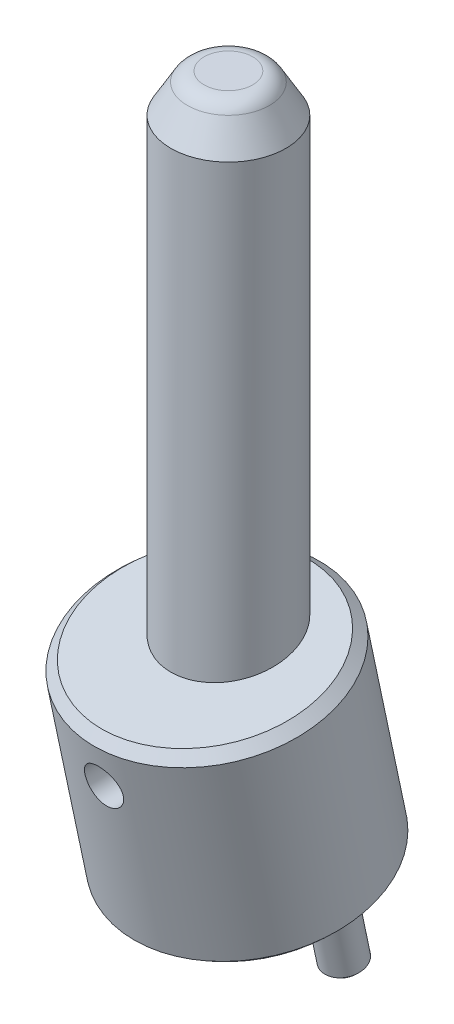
ISO-10303-21;
HEADER;
FILE_DESCRIPTION(('STEP AP214'),'2;1');
FILE_NAME('part.step','',(''),(''),'','','');
FILE_SCHEMA(('AUTOMOTIVE_DESIGN { 1 0 10303 214 1 1 1 1 }'));
ENDSEC;
DATA;
#1=APPLICATION_CONTEXT('core data for automotive mechanical design processes');
#2=APPLICATION_PROTOCOL_DEFINITION('international standard','automotive_design',2000,#1);
#3=PRODUCT_CONTEXT('',#1,'mechanical');
#4=PRODUCT('Part','Part','',(#3));
#5=PRODUCT_RELATED_PRODUCT_CATEGORY('part','',(#4));
#6=PRODUCT_DEFINITION_FORMATION('','',#4);
#7=PRODUCT_DEFINITION_CONTEXT('part definition',#1,'design');
#8=PRODUCT_DEFINITION('design','',#6,#7);
#9=PRODUCT_DEFINITION_SHAPE('','',#8);
#10=(LENGTH_UNIT() NAMED_UNIT(*) SI_UNIT(.MILLI.,.METRE.));
#11=(NAMED_UNIT(*) PLANE_ANGLE_UNIT() SI_UNIT($,.RADIAN.));
#12=(NAMED_UNIT(*) SI_UNIT($,.STERADIAN.) SOLID_ANGLE_UNIT());
#13=UNCERTAINTY_MEASURE_WITH_UNIT(LENGTH_MEASURE(1.E-05),#10,'distance_accuracy_value','');
#14=(GEOMETRIC_REPRESENTATION_CONTEXT(3) GLOBAL_UNCERTAINTY_ASSIGNED_CONTEXT((#13)) GLOBAL_UNIT_ASSIGNED_CONTEXT((#10,
#11,#12)) REPRESENTATION_CONTEXT('',''));
#15=CARTESIAN_POINT('',(0.,0.,0.));
#16=DIRECTION('',(0.,0.,1.));
#17=DIRECTION('',(1.,0.,0.));
#18=AXIS2_PLACEMENT_3D('',#15,#16,#17);
#19=CARTESIAN_POINT('',(0.,68.,0.));
#20=DIRECTION('',(0.,1.,0.));
#21=DIRECTION('',(-1.,0.,0.));
#22=AXIS2_PLACEMENT_3D('',#19,#20,#21);
#23=PLANE('',#22);
#24=CARTESIAN_POINT('',(0.,68.,-2.535898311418));
#25=CARTESIAN_POINT('',(0.036883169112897,68.,-2.53589886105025));
#26=CARTESIAN_POINT('',(0.073766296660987,68.,-2.53509366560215));
#27=CARTESIAN_POINT('',(0.147462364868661,68.,-2.53187573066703));
#28=CARTESIAN_POINT('',(0.184275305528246,68.,-2.52946299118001));
#29=CARTESIAN_POINT('',(0.257760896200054,68.,-2.52303391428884));
#30=CARTESIAN_POINT('',(0.294433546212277,68.,-2.51901757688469));
#31=CARTESIAN_POINT('',(0.367568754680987,68.,-2.50938912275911));
#32=CARTESIAN_POINT('',(0.404031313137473,68.,-2.50377700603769));
#33=CARTESIAN_POINT('',(0.476676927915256,68.,-2.49096762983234));
#34=CARTESIAN_POINT('',(0.512859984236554,68.,-2.48377037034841));
#35=CARTESIAN_POINT('',(0.584877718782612,68.,-2.46780442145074));
#36=CARTESIAN_POINT('',(0.620712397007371,68.,-2.459035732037));
#37=CARTESIAN_POINT('',(0.6919651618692,68.,-2.43994361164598));
#38=CARTESIAN_POINT('',(0.72738324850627,68.,-2.42962018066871));
#39=CARTESIAN_POINT('',(0.79773540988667,68.,-2.4074382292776));
#40=CARTESIAN_POINT('',(0.83266948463,68.,-2.39557970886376));
#41=CARTESIAN_POINT('',(0.901987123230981,68.,-2.37035015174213));
#42=CARTESIAN_POINT('',(0.936370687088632,68.,-2.35697911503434));
#43=CARTESIAN_POINT('',(1.00452185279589,68.,-2.32874997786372));
#44=CARTESIAN_POINT('',(1.0382894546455,68.,-2.31389187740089));
#45=CARTESIAN_POINT('',(1.10514441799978,68.,-2.28271689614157));
#46=CARTESIAN_POINT('',(1.13823177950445,68.,-2.26640001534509));
#47=CARTESIAN_POINT('',(1.20366327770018,68.,-2.23233853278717));
#48=CARTESIAN_POINT('',(1.23600741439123,68.,-2.21459393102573));
#49=CARTESIAN_POINT('',(1.29989089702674,68.,-2.17771078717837));
#50=CARTESIAN_POINT('',(1.3314302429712,68.,-2.15857224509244));
#51=CARTESIAN_POINT('',(1.3936440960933,68.,-2.11893764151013));
#52=CARTESIAN_POINT('',(1.42431860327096,67.9999999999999,-2.09844158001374));
#53=CARTESIAN_POINT('',(1.48474442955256,68.0000000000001,-2.05613099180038));
#54=CARTESIAN_POINT('',(1.51449574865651,68.0000000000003,-2.03431646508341));
#55=CARTESIAN_POINT('',(1.57301841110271,67.9999999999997,-1.98941032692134));
#56=CARTESIAN_POINT('',(1.60178975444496,67.9999999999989,-1.96631871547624));
#57=CARTESIAN_POINT('',(1.65829827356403,68.0000000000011,-1.91890290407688));
#58=CARTESIAN_POINT('',(1.68603544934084,68.0000000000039,-1.89457870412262));
#59=CARTESIAN_POINT('',(1.74042068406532,67.9999999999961,-1.8447420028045));
#60=CARTESIAN_POINT('',(1.76706874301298,67.9999999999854,-1.81922950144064));
#61=CARTESIAN_POINT('',(1.8202925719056,68.0000000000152,-1.76601289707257));
#62=CARTESIAN_POINT('',(1.84682143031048,68.0000000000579,-1.73826186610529));
#63=CARTESIAN_POINT('',(1.89860822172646,67.9999999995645,-1.68159729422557));
#64=CARTESIAN_POINT('',(1.9238661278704,67.9999999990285,-1.65268372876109));
#65=CARTESIAN_POINT('',(1.97305871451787,67.9999999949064,-1.59375026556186));
#66=CARTESIAN_POINT('',(1.99699333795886,67.9999999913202,-1.56373032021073));
#67=CARTESIAN_POINT('',(2.04349107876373,67.9999999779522,-1.50264174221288));
#68=CARTESIAN_POINT('',(2.06605410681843,67.9999999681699,-1.47157304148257));
#69=CARTESIAN_POINT('',(2.09883858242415,67.9999999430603,-1.42423763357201));
#70=CARTESIAN_POINT('',(2.10959070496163,67.9999999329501,-1.40833608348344));
#71=CARTESIAN_POINT('',(2.13071681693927,67.999999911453,-1.37630626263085));
#72=CARTESIAN_POINT('',(2.14109117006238,67.9999999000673,-1.36017823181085));
#73=CARTESIAN_POINT('',(2.17164317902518,67.9999998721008,-1.3114348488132));
#74=CARTESIAN_POINT('',(2.19125046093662,67.9999998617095,-1.27845923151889));
#75=CARTESIAN_POINT('',(2.22889472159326,67.9999998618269,-1.21162643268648));
#76=CARTESIAN_POINT('',(2.24693170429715,67.9999998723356,-1.17776925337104));
#77=CARTESIAN_POINT('',(2.28142653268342,67.9999999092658,-1.1092602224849));
#78=CARTESIAN_POINT('',(2.2978844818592,67.9999999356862,-1.07460842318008));
#79=CARTESIAN_POINT('',(2.32906360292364,67.9999999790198,-1.00453892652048));
#80=CARTESIAN_POINT('',(2.34378499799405,67.9999999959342,-0.969121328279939));
#81=CARTESIAN_POINT('',(2.36475646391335,68.0000000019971,-0.915929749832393));
#82=CARTESIAN_POINT('',(2.37150563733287,68.0000000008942,-0.89834771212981));
#83=CARTESIAN_POINT('',(2.3993801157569,67.9999999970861,-0.823272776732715));
#84=CARTESIAN_POINT('',(2.41865195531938,67.9999999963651,-0.765068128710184));
#85=CARTESIAN_POINT('',(2.44418154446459,67.9999999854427,-0.677429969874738));
#86=CARTESIAN_POINT('',(2.45206541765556,67.9999999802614,-0.648455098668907));
#87=CARTESIAN_POINT('',(2.46787714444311,67.9999999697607,-0.585935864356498));
#88=CARTESIAN_POINT('',(2.4756393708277,67.9999999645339,-0.552348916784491));
#89=CARTESIAN_POINT('',(2.48574292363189,67.999999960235,-0.504089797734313));
#90=CARTESIAN_POINT('',(2.4886547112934,67.999999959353,-0.489534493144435));
#91=CARTESIAN_POINT('',(2.49475257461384,67.9999999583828,-0.457572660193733));
#92=CARTESIAN_POINT('',(2.49788385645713,67.9999999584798,-0.440155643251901));
#93=CARTESIAN_POINT('',(2.50672485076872,67.9999999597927,-0.387811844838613));
#94=CARTESIAN_POINT('',(2.51188216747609,67.9999999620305,-0.352790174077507));
#95=CARTESIAN_POINT('',(2.52071043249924,67.9999999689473,-0.282561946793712));
#96=CARTESIAN_POINT('',(2.52438141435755,67.9999999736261,-0.247355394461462));
#97=CARTESIAN_POINT('',(2.53023391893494,67.9999999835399,-0.176819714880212));
#98=CARTESIAN_POINT('',(2.53241550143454,67.9999999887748,-0.141490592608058));
#99=CARTESIAN_POINT('',(2.53527542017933,67.9999999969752,-0.0707738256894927));
#100=CARTESIAN_POINT('',(2.53595384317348,67.9999999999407,-0.0353861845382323));
#101=CARTESIAN_POINT('',(2.53584272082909,68.0000000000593,0.0354236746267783));
#102=CARTESIAN_POINT('',(2.53505161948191,67.9999999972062,0.07084588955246));
#103=CARTESIAN_POINT('',(2.53203406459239,67.9999999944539,0.141627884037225));
#104=CARTESIAN_POINT('',(2.52980765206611,67.9999999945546,0.176987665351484));
#105=CARTESIAN_POINT('',(2.52391931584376,67.9999999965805,0.247588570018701));
#106=CARTESIAN_POINT('',(2.52025736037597,67.9999999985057,0.282829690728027));
#107=CARTESIAN_POINT('',(2.51148467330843,68.0000000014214,0.353133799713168));
#108=CARTESIAN_POINT('',(2.50637383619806,68.0000000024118,0.388196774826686));
#109=CARTESIAN_POINT('',(2.49768726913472,67.9999999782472,0.440622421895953));
#110=CARTESIAN_POINT('',(2.49462144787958,67.9999999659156,0.458070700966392));
#111=CARTESIAN_POINT('',(2.48998638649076,67.9999999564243,0.48262212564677));
#112=CARTESIAN_POINT('',(2.48860040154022,67.9999999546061,0.489759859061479));
#113=CARTESIAN_POINT('',(2.48087790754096,67.999999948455,0.528551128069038));
#114=CARTESIAN_POINT('',(2.47391141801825,67.9999999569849,0.560081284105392));
#115=CARTESIAN_POINT('',(2.45703812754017,67.9999999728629,0.630094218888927));
#116=CARTESIAN_POINT('',(2.44682379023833,67.9999999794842,0.66850231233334));
#117=CARTESIAN_POINT('',(2.42009300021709,67.9999999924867,0.760237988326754));
#118=CARTESIAN_POINT('',(2.40269884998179,67.9999999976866,0.813314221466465));
#119=CARTESIAN_POINT('',(2.37532992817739,67.9999999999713,0.888439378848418));
#120=CARTESIAN_POINT('',(2.36674512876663,67.9999999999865,0.911006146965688));
#121=CARTESIAN_POINT('',(2.34370620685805,68.0000000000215,0.969129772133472));
#122=CARTESIAN_POINT('',(2.32877605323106,68.000000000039,1.00450008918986));
#123=CARTESIAN_POINT('',(2.29733863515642,67.9999999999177,1.07453194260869));
#124=CARTESIAN_POINT('',(2.28083134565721,67.9999999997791,1.10919346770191));
#125=CARTESIAN_POINT('',(2.24628151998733,67.9999999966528,1.17774452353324));
#126=CARTESIAN_POINT('',(2.22823891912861,67.9999999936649,1.21163402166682));
#127=CARTESIAN_POINT('',(2.19064876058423,67.9999999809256,1.27857233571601));
#128=CARTESIAN_POINT('',(2.17110110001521,67.9999999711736,1.31162109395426));
#129=CARTESIAN_POINT('',(2.14068915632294,67.9999999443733,1.3605143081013));
#130=CARTESIAN_POINT('',(2.13036939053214,67.9999999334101,1.37669975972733));
#131=CARTESIAN_POINT('',(2.10937145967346,67.9999999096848,1.40881381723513));
#132=CARTESIAN_POINT('',(2.09869365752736,67.9999998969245,1.4247426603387));
#133=CARTESIAN_POINT('',(2.06610221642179,67.9999998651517,1.47214715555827));
#134=CARTESIAN_POINT('',(2.04363000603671,67.999999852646,1.50324163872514));
#135=CARTESIAN_POINT('',(1.99724969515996,67.9999998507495,1.56433742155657));
#136=CARTESIAN_POINT('',(1.97334159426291,67.9999998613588,1.59433872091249));
#137=CARTESIAN_POINT('',(1.92416677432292,67.9999999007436,1.65320597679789));
#138=CARTESIAN_POINT('',(1.89890014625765,67.999999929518,1.68207200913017));
#139=CARTESIAN_POINT('',(1.84696904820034,67.999999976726,1.73850866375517));
#140=CARTESIAN_POINT('',(1.82030476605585,67.999999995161,1.76607945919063));
#141=CARTESIAN_POINT('',(1.77844405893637,68.0000000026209,1.80781307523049));
#142=CARTESIAN_POINT('',(1.76359360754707,68.0000000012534,1.82232877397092));
#143=CARTESIAN_POINT('',(1.70076532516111,67.9999999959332,1.8822704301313));
#144=CARTESIAN_POINT('',(1.65118457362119,67.9999999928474,1.92605591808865));
#145=CARTESIAN_POINT('',(1.5748830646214,67.9999999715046,1.9882957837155));
#146=CARTESIAN_POINT('',(1.54939187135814,67.9999999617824,2.00828585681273));
#147=CARTESIAN_POINT('',(1.49369879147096,67.9999999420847,2.050241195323));
#148=CARTESIAN_POINT('',(1.46337192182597,67.9999999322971,2.07204201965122));
#149=CARTESIAN_POINT('',(1.41924057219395,67.9999999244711,2.10228130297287));
#150=CARTESIAN_POINT('',(1.40582016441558,67.9999999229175,2.11128590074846));
#151=CARTESIAN_POINT('',(1.37628726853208,67.9999999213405,2.13068692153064));
#152=CARTESIAN_POINT('',(1.36013950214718,67.9999999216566,2.14102971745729));
#153=CARTESIAN_POINT('',(1.31134786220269,67.9999999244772,2.17149865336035));
#154=CARTESIAN_POINT('',(1.27835328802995,67.9999999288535,2.19106696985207));
#155=CARTESIAN_POINT('',(1.21150292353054,67.9999999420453,2.22866698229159));
#156=CARTESIAN_POINT('',(1.17764716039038,67.9999999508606,2.2466987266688));
#157=CARTESIAN_POINT('',(1.10914688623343,67.9999999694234,2.28119223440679));
#158=CARTESIAN_POINT('',(1.07450241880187,67.9999999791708,2.29765408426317));
#159=CARTESIAN_POINT('',(1.00449363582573,67.9999999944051,2.32896042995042));
#160=CARTESIAN_POINT('',(0.969129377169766,67.9999999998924,2.34380505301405));
#161=CARTESIAN_POINT('',(0.900489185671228,68.0000000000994,2.37082264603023));
#162=CARTESIAN_POINT('',(0.867259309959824,67.9999999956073,2.383112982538));
#163=CARTESIAN_POINT('',(0.800333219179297,67.9999999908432,2.40634607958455));
#164=CARTESIAN_POINT('',(0.766637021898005,67.9999999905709,2.4172888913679));
#165=CARTESIAN_POINT('',(0.698829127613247,67.9999999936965,2.43780461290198));
#166=CARTESIAN_POINT('',(0.664717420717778,67.9999999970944,2.44737748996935));
#167=CARTESIAN_POINT('',(0.596126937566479,68.0000000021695,2.46511837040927));
#168=CARTESIAN_POINT('',(0.561648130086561,68.0000000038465,2.47328625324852));
#169=CARTESIAN_POINT('',(0.515953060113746,67.9999999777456,2.48318601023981));
#170=CARTESIAN_POINT('',(0.504864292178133,67.999999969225,2.48551694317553));
#171=CARTESIAN_POINT('',(0.482616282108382,67.9999999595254,2.48998940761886));
#172=CARTESIAN_POINT('',(0.471456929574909,67.9999999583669,2.492130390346));
#173=CARTESIAN_POINT('',(0.423172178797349,67.9999999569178,2.50104304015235));
#174=CARTESIAN_POINT('',(0.385898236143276,67.999999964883,2.50702839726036));
#175=CARTESIAN_POINT('',(0.321772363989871,67.9999999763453,2.51585849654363));
#176=CARTESIAN_POINT('',(0.294975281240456,67.9999999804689,2.5191122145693));
#177=CARTESIAN_POINT('',(0.23919081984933,67.9999999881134,2.52498124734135));
#178=CARTESIAN_POINT('',(0.210196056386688,67.9999999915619,2.52752672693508));
#179=CARTESIAN_POINT('',(0.144283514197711,67.9999999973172,2.53217247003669));
#180=CARTESIAN_POINT('',(0.107343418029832,67.9999999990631,2.5339662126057));
#181=CARTESIAN_POINT('',(0.0598216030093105,67.9999999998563,2.535240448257));
#182=CARTESIAN_POINT('',(0.0492560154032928,67.9999999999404,2.53545812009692));
#183=CARTESIAN_POINT('',(0.0257940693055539,68.0000000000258,2.5358007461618));
#184=CARTESIAN_POINT('',(0.0128972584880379,68.0000000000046,2.53589469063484));
#185=CARTESIAN_POINT('',(0.,68.,2.535898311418));
#186=B_SPLINE_CURVE_WITH_KNOTS('',3,(#24,#25,#26,#27,#28,#29,#30,#31,#32,#33,#34,#35,#36,#37,
#38,#39,#40,#41,#42,#43,#44,#45,#46,#47,#48,#49,#50,#51,#52,#53,#54,#55,#56,#57,#58,#59,#60,#61,
#62,#63,#64,#65,#66,#67,#68,#69,#70,#71,#72,#73,#74,#75,#76,#77,#78,#79,#80,#81,#82,#83,#84,#85,
#86,#87,#88,#89,#90,#91,#92,#93,#94,#95,#96,#97,#98,#99,#100,#101,#102,#103,#104,#105,#106,#107,
#108,#109,#110,#111,#112,#113,#114,#115,#116,#117,#118,#119,#120,#121,#122,#123,#124,#125,#126,
#127,#128,#129,#130,#131,#132,#133,#134,#135,#136,#137,#138,#139,#140,#141,#142,#143,#144,#145,
#146,#147,#148,#149,#150,#151,#152,#153,#154,#155,#156,#157,#158,#159,#160,#161,#162,#163,#164,
#165,#166,#167,#168,#169,#170,#171,#172,#173,#174,#175,#176,#177,#178,#179,#180,#181,#182,#183,
#184,#185),.UNSPECIFIED.,.F.,.F.,(4,2,2,2,2,2,2,2,2,2,2,2,2,2,2,2,2,2,2,2,2,2,2,2,2,2,2,2,2,2,2,
2,2,2,2,2,2,2,2,2,2,2,2,2,2,2,2,2,2,2,2,2,2,2,2,2,2,2,2,2,2,2,2,2,2,2,2,2,2,2,2,2,2,2,2,2,2,2,2,
2,4),(0.,0.110640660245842,0.221281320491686,0.331921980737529,0.442562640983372,
0.553203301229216,0.663843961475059,0.774484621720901,0.885125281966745,0.995765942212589,
1.10640660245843,1.21704726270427,1.32768792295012,1.43832858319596,1.5489692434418,
1.65960990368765,1.77025056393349,1.88089122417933,1.99153188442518,2.1066670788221,
2.22180470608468,2.33694729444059,2.4520973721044,2.50967964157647,2.56720492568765,
2.68225193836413,2.79729866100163,2.91233783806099,3.02736221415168,3.08386094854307,
3.26759502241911,3.35766742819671,3.46104881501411,3.50557819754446,3.5586633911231,
3.664827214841,3.77098864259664,3.87714580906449,3.98329684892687,4.08956035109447,
4.19582081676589,4.30208363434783,4.40835419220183,4.46149681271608,4.48330971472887,
4.58015248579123,4.69934379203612,4.86676229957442,4.93919017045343,5.05432498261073,
5.16946162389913,5.28460311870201,5.39975249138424,5.45733469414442,5.51486019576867,
5.62990814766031,5.7449561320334,5.8599964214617,5.97502128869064,6.03732000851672,
6.23550767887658,6.33267539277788,6.44467917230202,6.49316106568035,6.55068488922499,
6.66572394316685,6.78075936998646,6.89578845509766,7.01080848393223,7.11706931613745,
7.22332610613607,7.32958543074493,7.43585386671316,7.46984616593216,7.50393367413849,
7.61714192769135,7.69811153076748,7.78541399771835,7.89632395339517,7.92802697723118,
7.96671753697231),.UNSPECIFIED.);
#187=CARTESIAN_POINT('',(0.,68.,-2.5358983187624));
#188=VERTEX_POINT('',#187);
#189=CARTESIAN_POINT('',(0.,68.,2.5358983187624));
#190=VERTEX_POINT('',#189);
#191=EDGE_CURVE('P0_E38',#188,#190,#186,.T.);
#192=ORIENTED_EDGE('',*,*,#191,.F.);
#193=CARTESIAN_POINT('',(0.,68.,0.));
#194=DIRECTION('',(0.,-1.,0.));
#195=DIRECTION('',(0.,0.,1.));
#196=AXIS2_PLACEMENT_3D('',#193,#194,#195);
#197=CIRCLE('',#196,2.535898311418);
#198=EDGE_CURVE('P0_E42',#190,#188,#197,.T.);
#199=ORIENTED_EDGE('',*,*,#198,.F.);
#200=EDGE_LOOP('',(#192,#199));
#201=FACE_BOUND('',#200,.T.);
#202=ADVANCED_FACE('P0_F17',(#201),#23,.T.);
#203=CARTESIAN_POINT('',(0.,66.,0.));
#204=DIRECTION('',(0.,1.,0.));
#205=DIRECTION('',(0.0152566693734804,0.,0.999883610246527));
#206=AXIS2_PLACEMENT_3D('',#203,#204,#205);
#207=TOROIDAL_SURFACE('',#206,2.535898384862,2.);
#208=ORIENTED_EDGE('',*,*,#191,.T.);
#209=ORIENTED_EDGE('',*,*,#198,.T.);
#210=EDGE_LOOP('',(#208,#209));
#211=FACE_BOUND('',#210,.T.);
#212=CARTESIAN_POINT('',(0.,67.000000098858,0.));
#213=DIRECTION('',(0.,-1.,0.));
#214=DIRECTION('',(0.,0.,1.));
#215=AXIS2_PLACEMENT_3D('',#212,#213,#214);
#216=CIRCLE('',#215,4.26794913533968);
#217=CARTESIAN_POINT('',(0.,67.000000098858,4.26794913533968));
#218=VERTEX_POINT('',#217);
#219=EDGE_CURVE('P0_E48',#218,#218,#216,.T.);
#220=ORIENTED_EDGE('',*,*,#219,.F.);
#221=EDGE_LOOP('',(#220));
#222=FACE_BOUND('',#221,.T.);
#223=ADVANCED_FACE('P0_F40',(#211,#222),#207,.T.);
#224=CARTESIAN_POINT('',(0.,0.,0.));
#225=DIRECTION('',(0.,1.,0.));
#226=DIRECTION('',(-1.,0.,0.));
#227=AXIS2_PLACEMENT_3D('',#224,#225,#226);
#228=PLANE('',#227);
#229=CARTESIAN_POINT('',(0.,0.,0.));
#230=DIRECTION('',(0.,1.,0.));
#231=DIRECTION('',(-1.,0.,0.));
#232=AXIS2_PLACEMENT_3D('',#229,#230,#231);
#233=CIRCLE('',#232,5.00000122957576);
#234=CARTESIAN_POINT('',(-5.00000122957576,0.,0.));
#235=VERTEX_POINT('',#234);
#236=EDGE_CURVE('P0_E85',#235,#235,#233,.T.);
#237=ORIENTED_EDGE('',*,*,#236,.F.);
#238=EDGE_LOOP('',(#237));
#239=FACE_BOUND('',#238,.T.);
#240=ADVANCED_FACE('P0_F76',(#239),#228,.F.);
#241=CARTESIAN_POINT('',(0.,10.,2.15470053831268));
#242=DIRECTION('',(0.,0.,1.));
#243=DIRECTION('',(0.,-1.,0.));
#244=AXIS2_PLACEMENT_3D('',#241,#242,#243);
#245=CONICAL_SURFACE('',#244,2.00000000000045,1.0471975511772);
#246=CARTESIAN_POINT('',(0.,9.99999999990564,0.99999999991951));
#247=VERTEX_POINT('',#246);
#248=VERTEX_LOOP('',#247);
#249=FACE_BOUND('',#248,.T.);
#250=CARTESIAN_POINT('',(0.,10.,2.154700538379));
#251=DIRECTION('',(0.,0.,1.));
#252=DIRECTION('',(0.,-1.,0.));
#253=AXIS2_PLACEMENT_3D('',#250,#251,#252);
#254=CIRCLE('',#253,2.);
#255=CARTESIAN_POINT('',(0.,8.,2.154700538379));
#256=VERTEX_POINT('',#255);
#257=EDGE_CURVE('P0_E82',#256,#256,#254,.T.);
#258=ORIENTED_EDGE('',*,*,#257,.T.);
#259=EDGE_LOOP('',(#258));
#260=FACE_BOUND('',#259,.T.);
#261=ADVANCED_FACE('P0_F116',(#249,#260),#245,.F.);
#262=CARTESIAN_POINT('',(0.,63.9999999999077,0.));
#263=DIRECTION('',(0.,-1.,0.));
#264=DIRECTION('',(1.,0.,0.));
#265=AXIS2_PLACEMENT_3D('',#262,#263,#264);
#266=CONICAL_SURFACE('',#265,6.00000000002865,0.523598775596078);
#267=CARTESIAN_POINT('',(0.,64.,0.));
#268=DIRECTION('',(0.,1.,0.));
#269=DIRECTION('',(-1.,0.,0.));
#270=AXIS2_PLACEMENT_3D('',#267,#268,#269);
#271=CIRCLE('',#270,6.);
#272=CARTESIAN_POINT('',(-6.,64.,0.));
#273=VERTEX_POINT('',#272);
#274=EDGE_CURVE('P0_E92',#273,#273,#271,.F.);
#275=ORIENTED_EDGE('',*,*,#274,.F.);
#276=EDGE_LOOP('',(#275));
#277=FACE_BOUND('',#276,.T.);
#278=ORIENTED_EDGE('',*,*,#219,.T.);
#279=EDGE_LOOP('',(#278));
#280=FACE_BOUND('',#279,.T.);
#281=ADVANCED_FACE('P0_F108',(#277,#280),#266,.T.);
#282=CARTESIAN_POINT('',(0.,1.00000004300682,0.));
#283=DIRECTION('',(0.,1.,0.));
#284=DIRECTION('',(-1.,0.,0.));
#285=AXIS2_PLACEMENT_3D('',#282,#283,#284);
#286=CONICAL_SURFACE('',#285,6.0000015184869,0.785398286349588);
#287=CARTESIAN_POINT('',(0.,1.000001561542,0.));
#288=DIRECTION('',(0.,1.,0.));
#289=DIRECTION('',(-1.,0.,0.));
#290=AXIS2_PLACEMENT_3D('',#287,#288,#289);
#291=CIRCLE('',#290,6.);
#292=CARTESIAN_POINT('',(-6.,1.000001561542,0.));
#293=VERTEX_POINT('',#292);
#294=EDGE_CURVE('P0_E28',#293,#293,#291,.T.);
#295=ORIENTED_EDGE('',*,*,#294,.F.);
#296=EDGE_LOOP('',(#295));
#297=FACE_BOUND('',#296,.T.);
#298=ORIENTED_EDGE('',*,*,#236,.T.);
#299=EDGE_LOOP('',(#298));
#300=FACE_BOUND('',#299,.T.);
#301=ADVANCED_FACE('P0_F105',(#297,#300),#286,.T.);
#302=CARTESIAN_POINT('',(0.,10.,0.65));
#303=DIRECTION('',(0.,0.,1.));
#304=DIRECTION('',(0.,-1.,0.));
#305=AXIS2_PLACEMENT_3D('',#302,#303,#304);
#306=CYLINDRICAL_SURFACE('',#305,2.);
#307=ORIENTED_EDGE('',*,*,#257,.F.);
#308=EDGE_LOOP('',(#307));
#309=FACE_BOUND('',#308,.T.);
#310=CARTESIAN_POINT('',(0.,8.,6.));
#311=CARTESIAN_POINT('',(-0.108974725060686,8.00000612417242,5.99999564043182));
#312=CARTESIAN_POINT('',(-0.218061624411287,8.00894817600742,5.9969989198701));
#313=CARTESIAN_POINT('',(-0.433135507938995,8.04441497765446,5.98531898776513));
#314=CARTESIAN_POINT('',(-0.539117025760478,8.07096899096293,5.97662631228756));
#315=CARTESIAN_POINT('',(-0.744677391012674,8.14064454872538,5.9545040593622));
#316=CARTESIAN_POINT('',(-0.844270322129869,8.18372807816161,5.94108535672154));
#317=CARTESIAN_POINT('',(-1.03478027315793,8.2851008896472,5.91088362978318));
#318=CARTESIAN_POINT('',(-1.12569835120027,8.34338831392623,5.8941010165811));
#319=CARTESIAN_POINT('',(-1.29948066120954,8.475649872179,5.8582823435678));
#320=CARTESIAN_POINT('',(-1.3820029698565,8.55005856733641,5.83919212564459));
#321=CARTESIAN_POINT('',(-1.53366185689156,8.71152973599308,5.80120729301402));
#322=CARTESIAN_POINT('',(-1.60279478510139,8.79859564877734,5.78231273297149));
#323=CARTESIAN_POINT('',(-1.72765000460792,8.98597045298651,5.7462666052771));
#324=CARTESIAN_POINT('',(-1.78292996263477,9.08658794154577,5.72918070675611));
#325=CARTESIAN_POINT('',(-1.87563792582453,9.2963526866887,5.69950605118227));
#326=CARTESIAN_POINT('',(-1.91307145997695,9.40549728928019,5.68691590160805));
#327=CARTESIAN_POINT('',(-1.96774691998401,9.62534643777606,5.66822606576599));
#328=CARTESIAN_POINT('',(-1.98562689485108,9.73587440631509,5.66192191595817));
#329=CARTESIAN_POINT('',(-2.00268224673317,9.95852749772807,5.65591313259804));
#330=CARTESIAN_POINT('',(-2.00186340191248,10.0706521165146,5.65620646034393));
#331=CARTESIAN_POINT('',(-1.98203983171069,10.2878730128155,5.66318029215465));
#332=CARTESIAN_POINT('',(-1.96386791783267,10.393056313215,5.66956828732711));
#333=CARTESIAN_POINT('',(-1.9112124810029,10.5987863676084,5.68753310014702));
#334=CARTESIAN_POINT('',(-1.87672692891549,10.699332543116,5.69911056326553));
#335=CARTESIAN_POINT('',(-1.79187699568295,10.8948281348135,5.72635859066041));
#336=CARTESIAN_POINT('',(-1.74126547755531,10.9896611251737,5.74209216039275));
#337=CARTESIAN_POINT('',(-1.62577463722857,11.1697464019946,5.77585213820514));
#338=CARTESIAN_POINT('',(-1.56089195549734,11.2549964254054,5.79387908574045));
#339=CARTESIAN_POINT('',(-1.41471183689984,11.4181688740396,5.83134330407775));
#340=CARTESIAN_POINT('',(-1.33273573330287,11.4954788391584,5.85080514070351));
#341=CARTESIAN_POINT('',(-1.15670996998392,11.6354411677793,5.88813263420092));
#342=CARTESIAN_POINT('',(-1.06265504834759,11.6980871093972,5.90599758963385));
#343=CARTESIAN_POINT('',(-0.86381483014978,11.8074392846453,5.93835612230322));
#344=CARTESIAN_POINT('',(-0.75892625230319,11.8539693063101,5.95281190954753));
#345=CARTESIAN_POINT('',(-0.542326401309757,11.9284560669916,5.97642703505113));
#346=CARTESIAN_POINT('',(-0.430629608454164,11.9564508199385,5.98559720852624));
#347=CARTESIAN_POINT('',(-0.264915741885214,11.9830911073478,5.99438078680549));
#348=CARTESIAN_POINT('',(-0.212162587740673,11.9894240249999,5.99648164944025));
#349=CARTESIAN_POINT('',(-0.106281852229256,11.9978799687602,5.99929232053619));
#350=CARTESIAN_POINT('',(-0.0531542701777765,12.000002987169,6.00000212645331));
#351=CARTESIAN_POINT('',(0.108974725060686,11.9999938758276,5.99999564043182));
#352=CARTESIAN_POINT('',(0.218061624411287,11.9910518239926,5.9969989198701));
#353=CARTESIAN_POINT('',(0.433135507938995,11.9555850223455,5.98531898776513));
#354=CARTESIAN_POINT('',(0.539117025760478,11.9290310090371,5.97662631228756));
#355=CARTESIAN_POINT('',(0.744677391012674,11.8593554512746,5.9545040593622));
#356=CARTESIAN_POINT('',(0.844270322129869,11.8162719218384,5.94108535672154));
#357=CARTESIAN_POINT('',(1.03478027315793,11.7148991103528,5.91088362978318));
#358=CARTESIAN_POINT('',(1.12569835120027,11.6566116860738,5.8941010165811));
#359=CARTESIAN_POINT('',(1.29948066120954,11.524350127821,5.8582823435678));
#360=CARTESIAN_POINT('',(1.3820029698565,11.4499414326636,5.83919212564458));
#361=CARTESIAN_POINT('',(1.53366185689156,11.2884702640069,5.80120729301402));
#362=CARTESIAN_POINT('',(1.60279478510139,11.2014043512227,5.78231273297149));
#363=CARTESIAN_POINT('',(1.72765000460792,11.0140295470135,5.7462666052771));
#364=CARTESIAN_POINT('',(1.78292996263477,10.9134120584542,5.72918070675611));
#365=CARTESIAN_POINT('',(1.87563792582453,10.7036473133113,5.69950605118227));
#366=CARTESIAN_POINT('',(1.91307145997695,10.5945027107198,5.68691590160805));
#367=CARTESIAN_POINT('',(1.96774691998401,10.3746535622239,5.66822606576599));
#368=CARTESIAN_POINT('',(1.98562689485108,10.2641255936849,5.66192191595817));
#369=CARTESIAN_POINT('',(2.00268224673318,10.0414725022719,5.65591313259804));
#370=CARTESIAN_POINT('',(2.00186340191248,9.92934788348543,5.65620646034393));
#371=CARTESIAN_POINT('',(1.98203983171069,9.71212698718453,5.66318029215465));
#372=CARTESIAN_POINT('',(1.96386791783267,9.60694368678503,5.66956828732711));
#373=CARTESIAN_POINT('',(1.9112124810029,9.40121363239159,5.68753310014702));
#374=CARTESIAN_POINT('',(1.87672692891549,9.30066745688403,5.69911056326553));
#375=CARTESIAN_POINT('',(1.79187699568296,9.10517186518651,5.72635859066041));
#376=CARTESIAN_POINT('',(1.74126547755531,9.01033887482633,5.74209216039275));
#377=CARTESIAN_POINT('',(1.62577463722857,8.83025359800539,5.77585213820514));
#378=CARTESIAN_POINT('',(1.56089195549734,8.74500357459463,5.79387908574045));
#379=CARTESIAN_POINT('',(1.41471183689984,8.58183112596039,5.83134330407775));
#380=CARTESIAN_POINT('',(1.33273573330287,8.50452116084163,5.85080514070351));
#381=CARTESIAN_POINT('',(1.15670996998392,8.36455883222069,5.88813263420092));
#382=CARTESIAN_POINT('',(1.06265504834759,8.30191289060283,5.90599758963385));
#383=CARTESIAN_POINT('',(0.86381483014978,8.19256071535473,5.93835612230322));
#384=CARTESIAN_POINT('',(0.75892625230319,8.14603069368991,5.95281190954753));
#385=CARTESIAN_POINT('',(0.542326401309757,8.07154393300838,5.97642703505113));
#386=CARTESIAN_POINT('',(0.430629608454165,8.04354918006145,5.98559720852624));
#387=CARTESIAN_POINT('',(0.264915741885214,8.01690889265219,5.99438078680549));
#388=CARTESIAN_POINT('',(0.212162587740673,8.01057597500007,5.99648164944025));
#389=CARTESIAN_POINT('',(0.106281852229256,8.00212003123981,5.99929232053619));
#390=CARTESIAN_POINT('',(0.0531542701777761,7.99999701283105,6.00000212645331));
#391=CARTESIAN_POINT('',(0.,8.,6.));
#392=B_SPLINE_CURVE_WITH_KNOTS('',3,(#310,#311,#312,#313,#314,#315,#316,#317,#318,#319,#320,
#321,#322,#323,#324,#325,#326,#327,#328,#329,#330,#331,#332,#333,#334,#335,#336,#337,#338,#339,
#340,#341,#342,#343,#344,#345,#346,#347,#348,#349,#350,#351,#352,#353,#354,#355,#356,#357,#358,
#359,#360,#361,#362,#363,#364,#365,#366,#367,#368,#369,#370,#371,#372,#373,#374,#375,#376,#377,
#378,#379,#380,#381,#382,#383,#384,#385,#386,#387,#388,#389,#390,#391),.UNSPECIFIED.,.T.,.F.,(4,
2,2,2,2,2,2,2,2,2,2,2,2,2,2,2,2,2,2,2,2,2,2,2,2,2,2,2,2,2,2,2,2,2,2,2,2,2,2,2,4),(0.,
0.32671907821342,0.653982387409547,0.980497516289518,1.30697276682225,1.64368488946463,
1.98048867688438,2.32696849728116,2.67334090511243,3.00803851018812,3.34263269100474,
3.6619357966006,3.98127862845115,4.30577211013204,4.63034206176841,4.97180786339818,
5.31342292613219,5.65866330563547,6.00319342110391,6.16255590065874,6.32191867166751,
6.64863774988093,6.97590105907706,7.30241618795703,7.62889143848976,7.96560356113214,
8.30240734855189,8.64888716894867,8.99525957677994,9.32995718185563,9.66455136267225,
9.98385446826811,10.3031973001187,10.6276907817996,10.9522607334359,11.2937265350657,
11.6353415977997,11.980581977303,12.3251120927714,12.4844745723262,12.643837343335),.UNSPECIFIED.);
#393=CARTESIAN_POINT('',(0.,8.,6.));
#394=VERTEX_POINT('',#393);
#395=EDGE_CURVE('P0_E11',#394,#394,#392,.T.);
#396=ORIENTED_EDGE('',*,*,#395,.F.);
#397=EDGE_LOOP('',(#396));
#398=FACE_BOUND('',#397,.T.);
#399=ADVANCED_FACE('P0_F107',(#309,#398),#306,.F.);
#400=CARTESIAN_POINT('',(0.,-3.4,0.));
#401=DIRECTION('',(0.,1.,0.));
#402=DIRECTION('',(-1.,0.,0.));
#403=AXIS2_PLACEMENT_3D('',#400,#401,#402);
#404=CYLINDRICAL_SURFACE('',#403,6.);
#405=ORIENTED_EDGE('',*,*,#274,.T.);
#406=EDGE_LOOP('',(#405));
#407=FACE_BOUND('',#406,.T.);
#408=ORIENTED_EDGE('',*,*,#294,.T.);
#409=EDGE_LOOP('',(#408));
#410=FACE_BOUND('',#409,.T.);
#411=ORIENTED_EDGE('',*,*,#395,.T.);
#412=EDGE_LOOP('',(#411));
#413=FACE_BOUND('',#412,.T.);
#414=ADVANCED_FACE('P0_F102',(#407,#410,#413),#404,.T.);
#415=CLOSED_SHELL('',(#202,#223,#240,#261,#281,#301,#399,#414));
#416=MANIFOLD_SOLID_BREP('P0_B1',#415);
#417=CARTESIAN_POINT('',(0.,-9.90791204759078,-3.3761583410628));
#418=DIRECTION('',(0.,-0.978147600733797,-0.207911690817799));
#419=DIRECTION('',(0.,0.207911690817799,-0.978147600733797));
#420=AXIS2_PLACEMENT_3D('',#417,#418,#419);
#421=PLANE('',#420);
#422=CARTESIAN_POINT('',(-8.75,-9.90791204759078,-3.3761583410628));
#423=DIRECTION('',(0.,-0.978147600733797,-0.207911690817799));
#424=DIRECTION('',(0.,0.207911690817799,-0.978147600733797));
#425=AXIS2_PLACEMENT_3D('',#422,#423,#424);
#426=CIRCLE('',#425,1.49996275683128);
#427=CARTESIAN_POINT('',(-8.75,-9.59605225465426,-4.84334331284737));
#428=VERTEX_POINT('',#427);
#429=EDGE_CURVE('P1_E17',#428,#428,#426,.F.);
#430=ORIENTED_EDGE('',*,*,#429,.F.);
#431=EDGE_LOOP('',(#430));
#432=FACE_BOUND('',#431,.T.);
#433=ADVANCED_FACE('P1_F14',(#432),#421,.T.);
#434=CARTESIAN_POINT('',(0.,-9.90791204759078,-3.3761583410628));
#435=DIRECTION('',(0.,-0.978147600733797,-0.207911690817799));
#436=DIRECTION('',(0.,0.207911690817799,-0.978147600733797));
#437=AXIS2_PLACEMENT_3D('',#434,#435,#436);
#438=PLANE('',#437);
#439=CARTESIAN_POINT('',(8.75,-9.90791204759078,-3.3761583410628));
#440=DIRECTION('',(0.,-0.978147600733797,-0.207911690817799));
#441=DIRECTION('',(0.,0.207911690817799,-0.978147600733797));
#442=AXIS2_PLACEMENT_3D('',#439,#440,#441);
#443=CIRCLE('',#442,1.49996275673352);
#444=CARTESIAN_POINT('',(8.75,-9.59605225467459,-4.84334331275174));
#445=VERTEX_POINT('',#444);
#446=EDGE_CURVE('P1_E114',#445,#445,#443,.F.);
#447=ORIENTED_EDGE('',*,*,#446,.F.);
#448=EDGE_LOOP('',(#447));
#449=FACE_BOUND('',#448,.T.);
#450=ADVANCED_FACE('P1_F104',(#449),#438,.T.);
#451=CARTESIAN_POINT('',(0.,4.57966997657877E-13,7.85829734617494E-13));
#452=DIRECTION('',(0.,-1.,0.));
#453=DIRECTION('',(0.,0.,-1.));
#454=AXIS2_PLACEMENT_3D('',#451,#452,#453);
#455=PLANE('',#454);
#456=CARTESIAN_POINT('',(0.,2.86229373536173E-13,9.69710423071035E-13));
#457=DIRECTION('',(0.,-1.,0.));
#458=DIRECTION('',(0.,0.,-1.));
#459=AXIS2_PLACEMENT_3D('',#456,#457,#458);
#460=CIRCLE('',#459,6.);
#461=CARTESIAN_POINT('',(0.,2.86229373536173E-13,-5.99999999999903));
#462=VERTEX_POINT('',#461);
#463=EDGE_CURVE('P1_E116',#462,#462,#460,.F.);
#464=ORIENTED_EDGE('',*,*,#463,.T.);
#465=EDGE_LOOP('',(#464));
#466=FACE_BOUND('',#465,.T.);
#467=ADVANCED_FACE('P1_F101',(#466),#455,.F.);
#468=CARTESIAN_POINT('',(-8.75,-9.41881058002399,-3.27219661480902));
#469=DIRECTION('',(0.,0.978147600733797,0.207911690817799));
#470=DIRECTION('',(0.,-0.207911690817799,0.978147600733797));
#471=AXIS2_PLACEMENT_3D('',#468,#469,#470);
#472=CONICAL_SURFACE('',#471,1.99997862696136,0.785385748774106);
#473=CARTESIAN_POINT('',(-8.75,-9.41878967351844,-3.27219217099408));
#474=DIRECTION('',(0.,0.978147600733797,0.207911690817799));
#475=DIRECTION('',(0.,-0.207911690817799,0.978147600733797));
#476=AXIS2_PLACEMENT_3D('',#473,#474,#475);
#477=CIRCLE('',#476,2.);
#478=CARTESIAN_POINT('',(-8.75,-9.83461305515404,-1.31589696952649));
#479=VERTEX_POINT('',#478);
#480=EDGE_CURVE('P1_E118',#479,#479,#477,.T.);
#481=ORIENTED_EDGE('',*,*,#480,.F.);
#482=EDGE_LOOP('',(#481));
#483=FACE_BOUND('',#482,.T.);
#484=ORIENTED_EDGE('',*,*,#429,.T.);
#485=EDGE_LOOP('',(#484));
#486=FACE_BOUND('',#485,.T.);
#487=ADVANCED_FACE('P1_F97',(#483,#486),#472,.T.);
#488=CARTESIAN_POINT('',(8.75,-9.41881057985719,-3.27219661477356));
#489=DIRECTION('',(0.,0.978147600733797,0.207911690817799));
#490=DIRECTION('',(0.,-0.207911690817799,0.978147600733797));
#491=AXIS2_PLACEMENT_3D('',#488,#489,#490);
#492=CONICAL_SURFACE('',#491,1.99997862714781,0.785385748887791);
#493=CARTESIAN_POINT('',(8.75,-9.41878967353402,-3.27219217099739));
#494=DIRECTION('',(0.,0.978147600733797,0.207911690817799));
#495=DIRECTION('',(0.,-0.207911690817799,0.978147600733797));
#496=AXIS2_PLACEMENT_3D('',#493,#494,#495);
#497=CIRCLE('',#496,2.);
#498=CARTESIAN_POINT('',(8.75,-9.83461305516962,-1.3158969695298));
#499=VERTEX_POINT('',#498);
#500=EDGE_CURVE('P1_E123',#499,#499,#497,.T.);
#501=ORIENTED_EDGE('',*,*,#500,.F.);
#502=EDGE_LOOP('',(#501));
#503=FACE_BOUND('',#502,.T.);
#504=ORIENTED_EDGE('',*,*,#446,.T.);
#505=EDGE_LOOP('',(#504));
#506=FACE_BOUND('',#505,.T.);
#507=ADVANCED_FACE('P1_F92',(#503,#506),#492,.T.);
#508=CARTESIAN_POINT('',(0.,22.3422309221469,9.70577784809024E-13));
#509=DIRECTION('',(0.,-1.,0.));
#510=DIRECTION('',(0.,0.,-1.));
#511=AXIS2_PLACEMENT_3D('',#508,#509,#510);
#512=CYLINDRICAL_SURFACE('',#511,6.);
#513=CARTESIAN_POINT('',(0.,18.0000000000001,9.69710423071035E-13));
#514=DIRECTION('',(0.,0.978147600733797,0.207911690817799));
#515=DIRECTION('',(0.,-0.207911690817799,0.978147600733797));
#516=AXIS2_PLACEMENT_3D('',#513,#514,#515);
#517=ELLIPSE('',#516,6.13404356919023,6.);
#518=CARTESIAN_POINT('',(0.,16.7246606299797,6.00000000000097));
#519=VERTEX_POINT('',#518);
#520=EDGE_CURVE('P1_E79',#519,#519,#517,.F.);
#521=ORIENTED_EDGE('',*,*,#520,.F.);
#522=EDGE_LOOP('',(#521));
#523=FACE_BOUND('',#522,.T.);
#524=ORIENTED_EDGE('',*,*,#463,.F.);
#525=EDGE_LOOP('',(#524));
#526=FACE_BOUND('',#525,.T.);
#527=CARTESIAN_POINT('',(0.,12.0000000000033,6.00000000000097));
#528=CARTESIAN_POINT('',(-0.108974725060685,11.9999938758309,5.99999564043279));
#529=CARTESIAN_POINT('',(-0.218061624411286,11.9910518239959,5.99699891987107));
#530=CARTESIAN_POINT('',(-0.433135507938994,11.9555850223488,5.9853189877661));
#531=CARTESIAN_POINT('',(-0.539117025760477,11.9290310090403,5.97662631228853));
#532=CARTESIAN_POINT('',(-0.744677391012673,11.8593554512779,5.95450405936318));
#533=CARTESIAN_POINT('',(-0.844270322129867,11.8162719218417,5.94108535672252));
#534=CARTESIAN_POINT('',(-1.03478027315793,11.7148991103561,5.91088362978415));
#535=CARTESIAN_POINT('',(-1.12569835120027,11.656611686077,5.89410101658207));
#536=CARTESIAN_POINT('',(-1.29948066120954,11.5243501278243,5.85828234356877));
#537=CARTESIAN_POINT('',(-1.3820029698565,11.4499414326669,5.83919212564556));
#538=CARTESIAN_POINT('',(-1.53366185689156,11.2884702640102,5.80120729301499));
#539=CARTESIAN_POINT('',(-1.60279478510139,11.2014043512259,5.78231273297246));
#540=CARTESIAN_POINT('',(-1.72765000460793,11.0140295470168,5.74626660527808));
#541=CARTESIAN_POINT('',(-1.78292996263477,10.9134120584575,5.72918070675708));
#542=CARTESIAN_POINT('',(-1.87563792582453,10.7036473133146,5.69950605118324));
#543=CARTESIAN_POINT('',(-1.91307145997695,10.5945027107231,5.68691590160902));
#544=CARTESIAN_POINT('',(-1.96774691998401,10.3746535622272,5.66822606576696));
#545=CARTESIAN_POINT('',(-1.98562689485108,10.2641255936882,5.66192191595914));
#546=CARTESIAN_POINT('',(-2.00268224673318,10.0414725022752,5.65591313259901));
#547=CARTESIAN_POINT('',(-2.00186340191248,9.92934788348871,5.65620646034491));
#548=CARTESIAN_POINT('',(-1.98203983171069,9.71212698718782,5.66318029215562));
#549=CARTESIAN_POINT('',(-1.96386791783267,9.60694368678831,5.66956828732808));
#550=CARTESIAN_POINT('',(-1.9112124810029,9.40121363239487,5.68753310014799));
#551=CARTESIAN_POINT('',(-1.87672692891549,9.30066745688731,5.6991105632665));
#552=CARTESIAN_POINT('',(-1.79187699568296,9.10517186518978,5.72635859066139));
#553=CARTESIAN_POINT('',(-1.74126547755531,9.01033887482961,5.74209216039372));
#554=CARTESIAN_POINT('',(-1.62577463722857,8.83025359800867,5.77585213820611));
#555=CARTESIAN_POINT('',(-1.56089195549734,8.7450035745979,5.79387908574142));
#556=CARTESIAN_POINT('',(-1.41471183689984,8.58183112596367,5.83134330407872));
#557=CARTESIAN_POINT('',(-1.33273573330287,8.50452116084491,5.85080514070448));
#558=CARTESIAN_POINT('',(-1.15670996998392,8.36455883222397,5.88813263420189));
#559=CARTESIAN_POINT('',(-1.06265504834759,8.30191289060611,5.90599758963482));
#560=CARTESIAN_POINT('',(-0.863814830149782,8.19256071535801,5.93835612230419));
#561=CARTESIAN_POINT('',(-0.758926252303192,8.14603069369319,5.9528119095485));
#562=CARTESIAN_POINT('',(-0.542326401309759,8.07154393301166,5.9764270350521));
#563=CARTESIAN_POINT('',(-0.430629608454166,8.04354918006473,5.98559720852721));
#564=CARTESIAN_POINT('',(-0.264915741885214,8.01690889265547,5.99438078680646));
#565=CARTESIAN_POINT('',(-0.212162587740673,8.01057597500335,5.99648164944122));
#566=CARTESIAN_POINT('',(-0.106281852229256,8.00212003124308,5.99929232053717));
#567=CARTESIAN_POINT('',(-0.0531542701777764,7.99999701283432,6.00000212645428));
#568=CARTESIAN_POINT('',(0.108974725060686,8.0000061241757,5.99999564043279));
#569=CARTESIAN_POINT('',(0.218061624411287,8.0089481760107,5.99699891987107));
#570=CARTESIAN_POINT('',(0.433135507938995,8.04441497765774,5.9853189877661));
#571=CARTESIAN_POINT('',(0.539117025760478,8.07096899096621,5.97662631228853));
#572=CARTESIAN_POINT('',(0.744677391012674,8.14064454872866,5.95450405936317));
#573=CARTESIAN_POINT('',(0.844270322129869,8.18372807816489,5.94108535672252));
#574=CARTESIAN_POINT('',(1.03478027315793,8.28510088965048,5.91088362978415));
#575=CARTESIAN_POINT('',(1.12569835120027,8.34338831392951,5.89410101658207));
#576=CARTESIAN_POINT('',(1.29948066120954,8.47564987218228,5.85828234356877));
#577=CARTESIAN_POINT('',(1.3820029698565,8.55005856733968,5.83919212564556));
#578=CARTESIAN_POINT('',(1.53366185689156,8.71152973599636,5.80120729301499));
#579=CARTESIAN_POINT('',(1.60279478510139,8.79859564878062,5.78231273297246));
#580=CARTESIAN_POINT('',(1.72765000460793,8.98597045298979,5.74626660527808));
#581=CARTESIAN_POINT('',(1.78292996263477,9.08658794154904,5.72918070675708));
#582=CARTESIAN_POINT('',(1.87563792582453,9.29635268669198,5.69950605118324));
#583=CARTESIAN_POINT('',(1.91307145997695,9.40549728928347,5.68691590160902));
#584=CARTESIAN_POINT('',(1.96774691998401,9.62534643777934,5.66822606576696));
#585=CARTESIAN_POINT('',(1.98562689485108,9.73587440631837,5.66192191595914));
#586=CARTESIAN_POINT('',(2.00268224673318,9.95852749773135,5.65591313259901));
#587=CARTESIAN_POINT('',(2.00186340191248,10.0706521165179,5.65620646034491));
#588=CARTESIAN_POINT('',(1.98203983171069,10.2878730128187,5.66318029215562));
#589=CARTESIAN_POINT('',(1.96386791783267,10.3930563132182,5.66956828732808));
#590=CARTESIAN_POINT('',(1.9112124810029,10.5987863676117,5.68753310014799));
#591=CARTESIAN_POINT('',(1.87672692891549,10.6993325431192,5.6991105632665));
#592=CARTESIAN_POINT('',(1.79187699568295,10.8948281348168,5.72635859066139));
#593=CARTESIAN_POINT('',(1.74126547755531,10.9896611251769,5.74209216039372));
#594=CARTESIAN_POINT('',(1.62577463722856,11.1697464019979,5.77585213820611));
#595=CARTESIAN_POINT('',(1.56089195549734,11.2549964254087,5.79387908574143));
#596=CARTESIAN_POINT('',(1.41471183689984,11.4181688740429,5.83134330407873));
#597=CARTESIAN_POINT('',(1.33273573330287,11.4954788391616,5.85080514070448));
#598=CARTESIAN_POINT('',(1.15670996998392,11.6354411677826,5.88813263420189));
#599=CARTESIAN_POINT('',(1.06265504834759,11.6980871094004,5.90599758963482));
#600=CARTESIAN_POINT('',(0.86381483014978,11.8074392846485,5.93835612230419));
#601=CARTESIAN_POINT('',(0.75892625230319,11.8539693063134,5.9528119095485));
#602=CARTESIAN_POINT('',(0.542326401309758,11.9284560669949,5.9764270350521));
#603=CARTESIAN_POINT('',(0.430629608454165,11.9564508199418,5.98559720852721));
#604=CARTESIAN_POINT('',(0.264915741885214,11.9830911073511,5.99438078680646));
#605=CARTESIAN_POINT('',(0.212162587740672,11.9894240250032,5.99648164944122));
#606=CARTESIAN_POINT('',(0.106281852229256,11.9978799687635,5.99929232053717));
#607=CARTESIAN_POINT('',(0.0531542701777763,12.0000029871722,6.00000212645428));
#608=CARTESIAN_POINT('',(0.,12.0000000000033,6.00000000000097));
#609=B_SPLINE_CURVE_WITH_KNOTS('',3,(#527,#528,#529,#530,#531,#532,#533,#534,#535,#536,#537,
#538,#539,#540,#541,#542,#543,#544,#545,#546,#547,#548,#549,#550,#551,#552,#553,#554,#555,#556,
#557,#558,#559,#560,#561,#562,#563,#564,#565,#566,#567,#568,#569,#570,#571,#572,#573,#574,#575,
#576,#577,#578,#579,#580,#581,#582,#583,#584,#585,#586,#587,#588,#589,#590,#591,#592,#593,#594,
#595,#596,#597,#598,#599,#600,#601,#602,#603,#604,#605,#606,#607,#608),.UNSPECIFIED.,.T.,.F.,(4,
2,2,2,2,2,2,2,2,2,2,2,2,2,2,2,2,2,2,2,2,2,2,2,2,2,2,2,2,2,2,2,2,2,2,2,2,2,2,2,4),(0.,
0.326719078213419,0.653982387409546,0.980497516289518,1.30697276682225,1.64368488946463,
1.98048867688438,2.32696849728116,2.67334090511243,3.00803851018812,3.34263269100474,
3.6619357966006,3.98127862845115,4.30577211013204,4.63034206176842,4.97180786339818,
5.31342292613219,5.65866330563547,6.00319342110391,6.16255590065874,6.32191867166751,
6.64863774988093,6.97590105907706,7.30241618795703,7.62889143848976,7.96560356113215,
8.3024073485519,8.64888716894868,8.99525957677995,9.32995718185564,9.66455136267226,
9.98385446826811,10.3031973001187,10.6276907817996,10.9522607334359,11.2937265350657,
11.6353415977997,11.980581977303,12.3251120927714,12.4844745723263,12.643837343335),.UNSPECIFIED.);
#610=CARTESIAN_POINT('',(0.,12.0000000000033,6.00000000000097));
#611=VERTEX_POINT('',#610);
#612=EDGE_CURVE('P1_E76',#611,#611,#609,.T.);
#613=ORIENTED_EDGE('',*,*,#612,.T.);
#614=EDGE_LOOP('',(#613));
#615=FACE_BOUND('',#614,.T.);
#616=ADVANCED_FACE('P1_F86',(#523,#526,#615),#512,.F.);
#617=CARTESIAN_POINT('',(-8.75,-4.039026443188,-2.128688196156));
#618=DIRECTION('',(0.,-0.978147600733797,-0.207911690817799));
#619=DIRECTION('',(0.,0.207911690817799,-0.978147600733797));
#620=AXIS2_PLACEMENT_3D('',#617,#618,#619);
#621=CYLINDRICAL_SURFACE('',#620,2.);
#622=CARTESIAN_POINT('',(-8.75,-4.039026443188,-2.128688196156));
#623=DIRECTION('',(0.,-0.978147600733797,-0.207911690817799));
#624=DIRECTION('',(0.,0.207911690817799,-0.978147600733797));
#625=AXIS2_PLACEMENT_3D('',#622,#623,#624);
#626=CIRCLE('',#625,2.);
#627=CARTESIAN_POINT('',(-8.75,-3.6232030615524,-4.08498339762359));
#628=VERTEX_POINT('',#627);
#629=EDGE_CURVE('P1_E72',#628,#628,#626,.T.);
#630=ORIENTED_EDGE('',*,*,#629,.T.);
#631=EDGE_LOOP('',(#630));
#632=FACE_BOUND('',#631,.T.);
#633=ORIENTED_EDGE('',*,*,#480,.T.);
#634=EDGE_LOOP('',(#633));
#635=FACE_BOUND('',#634,.T.);
#636=ADVANCED_FACE('P1_F91',(#632,#635),#621,.T.);
#637=CARTESIAN_POINT('',(8.75,-4.039026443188,-2.128688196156));
#638=DIRECTION('',(0.,-0.978147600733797,-0.207911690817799));
#639=DIRECTION('',(0.,0.207911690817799,-0.978147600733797));
#640=AXIS2_PLACEMENT_3D('',#637,#638,#639);
#641=CYLINDRICAL_SURFACE('',#640,2.);
#642=CARTESIAN_POINT('',(8.75,-4.039026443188,-2.128688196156));
#643=DIRECTION('',(0.,-0.978147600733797,-0.207911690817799));
#644=DIRECTION('',(0.,0.207911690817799,-0.978147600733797));
#645=AXIS2_PLACEMENT_3D('',#642,#643,#644);
#646=CIRCLE('',#645,2.);
#647=CARTESIAN_POINT('',(8.75,-3.6232030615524,-4.08498339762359));
#648=VERTEX_POINT('',#647);
#649=EDGE_CURVE('P1_E68',#648,#648,#646,.T.);
#650=ORIENTED_EDGE('',*,*,#649,.T.);
#651=EDGE_LOOP('',(#650));
#652=FACE_BOUND('',#651,.T.);
#653=ORIENTED_EDGE('',*,*,#500,.T.);
#654=EDGE_LOOP('',(#653));
#655=FACE_BOUND('',#654,.T.);
#656=ADVANCED_FACE('P1_F139',(#652,#655),#641,.T.);
#657=CARTESIAN_POINT('',(0.,17.4802207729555,2.44536900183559));
#658=DIRECTION('',(0.,0.978147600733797,0.207911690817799));
#659=DIRECTION('',(0.,-0.207911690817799,0.978147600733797));
#660=AXIS2_PLACEMENT_3D('',#657,#658,#659);
#661=PLANE('',#660);
#662=ORIENTED_EDGE('',*,*,#520,.T.);
#663=EDGE_LOOP('',(#662));
#664=FACE_BOUND('',#663,.T.);
#665=CARTESIAN_POINT('',(0.,17.4802207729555,2.44536900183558));
#666=DIRECTION('',(0.,0.978147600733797,0.207911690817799));
#667=DIRECTION('',(0.,-0.207911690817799,0.978147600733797));
#668=AXIS2_PLACEMENT_3D('',#665,#666,#667);
#669=CIRCLE('',#668,11.0000028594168);
#670=CARTESIAN_POINT('',(0.,15.1931915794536,13.204995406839));
#671=VERTEX_POINT('',#670);
#672=EDGE_CURVE('P1_E38',#671,#671,#669,.F.);
#673=ORIENTED_EDGE('',*,*,#672,.F.);
#674=EDGE_LOOP('',(#673));
#675=FACE_BOUND('',#674,.T.);
#676=ADVANCED_FACE('P1_F63',(#664,#675),#661,.T.);
#677=CARTESIAN_POINT('',(0.,10.0000000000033,-2.50722077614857));
#678=DIRECTION('',(0.,0.,1.));
#679=DIRECTION('',(0.,-1.,0.));
#680=AXIS2_PLACEMENT_3D('',#677,#678,#679);
#681=CYLINDRICAL_SURFACE('',#680,2.);
#682=ORIENTED_EDGE('',*,*,#612,.F.);
#683=EDGE_LOOP('',(#682));
#684=FACE_BOUND('',#683,.T.);
#685=CARTESIAN_POINT('',(0.,8.00000000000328,12.6983730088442));
#686=CARTESIAN_POINT('',(-0.112086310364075,8.00000508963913,12.6983718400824));
#687=CARTESIAN_POINT('',(-0.224306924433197,8.00945934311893,12.6987604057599));
#688=CARTESIAN_POINT('',(-0.445717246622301,8.0470564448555,12.7004348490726));
#689=CARTESIAN_POINT('',(-0.554900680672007,8.07523536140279,12.7017224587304));
#690=CARTESIAN_POINT('',(-0.766921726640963,8.14947848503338,12.7055461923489));
#691=CARTESIAN_POINT('',(-0.869763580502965,8.19553058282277,12.7080814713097));
#692=CARTESIAN_POINT('',(-1.06618304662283,8.30416790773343,12.7149230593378));
#693=CARTESIAN_POINT('',(-1.15976466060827,8.36674595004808,12.7192285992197));
#694=CARTESIAN_POINT('',(-1.33491124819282,8.50649979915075,12.7302206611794));
#695=CARTESIAN_POINT('',(-1.416494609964,8.58365284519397,12.7369034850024));
#696=CARTESIAN_POINT('',(-1.56550675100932,8.75032617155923,12.7532561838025));
#697=CARTESIAN_POINT('',(-1.63293518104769,8.83984675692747,12.7629261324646));
#698=CARTESIAN_POINT('',(-1.75157177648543,9.0282262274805,12.7856909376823));
#699=CARTESIAN_POINT('',(-1.80283497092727,9.12705191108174,12.7987738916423));
#700=CARTESIAN_POINT('',(-1.88816001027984,9.33133982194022,12.8286206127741));
#701=CARTESIAN_POINT('',(-1.92222203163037,9.4368019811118,12.8453843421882));
#702=CARTESIAN_POINT('',(-1.97257119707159,9.65183308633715,12.8826258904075));
#703=CARTESIAN_POINT('',(-1.98876588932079,9.76142038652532,12.9031223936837));
#704=CARTESIAN_POINT('',(-2.00293899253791,9.98110701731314,12.9473741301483));
#705=CARTESIAN_POINT('',(-2.00091511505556,10.0912064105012,12.9711297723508));
#706=CARTESIAN_POINT('',(-1.97874639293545,10.3116600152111,13.0217996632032));
#707=CARTESIAN_POINT('',(-1.9581629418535,10.4219555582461,13.0487765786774));
#708=CARTESIAN_POINT('',(-1.89906127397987,10.637205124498,13.1043672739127));
#709=CARTESIAN_POINT('',(-1.86053911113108,10.7421579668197,13.1329814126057));
#710=CARTESIAN_POINT('',(-1.7651155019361,10.9474104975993,13.1915237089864));
#711=CARTESIAN_POINT('',(-1.70765805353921,11.0474485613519,13.2214643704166));
#712=CARTESIAN_POINT('',(-1.57623406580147,11.2364193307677,13.2801890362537));
#713=CARTESIAN_POINT('',(-1.50226667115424,11.3253514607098,13.3089729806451));
#714=CARTESIAN_POINT('',(-1.33911214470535,11.4900644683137,13.3638734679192));
#715=CARTESIAN_POINT('',(-1.24983943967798,11.565766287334,13.3899736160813));
#716=CARTESIAN_POINT('',(-1.05857206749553,11.7009195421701,13.4375943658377));
#717=CARTESIAN_POINT('',(-0.956574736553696,11.7603675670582,13.4591140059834));
#718=CARTESIAN_POINT('',(-0.747237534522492,11.8586166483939,13.4951896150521));
#719=CARTESIAN_POINT('',(-0.640294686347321,11.8981717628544,13.5099973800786));
#720=CARTESIAN_POINT('',(-0.420727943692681,11.9585407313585,13.5327552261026));
#721=CARTESIAN_POINT('',(-0.308120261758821,11.9794051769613,13.5407238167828));
#722=CARTESIAN_POINT('',(-0.162278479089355,11.9936720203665,13.546177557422));
#723=CARTESIAN_POINT('',(-0.129878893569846,11.9960428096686,13.5470844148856));
#724=CARTESIAN_POINT('',(-0.0649908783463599,11.9992075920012,13.5482957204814));
#725=CARTESIAN_POINT('',(-0.0325024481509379,12.0000015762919,13.5486001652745));
#726=CARTESIAN_POINT('',(0.107357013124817,11.9999947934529,13.54859625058));
#727=CARTESIAN_POINT('',(0.214866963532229,11.9913099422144,13.5452617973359));
#728=CARTESIAN_POINT('',(0.42686098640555,11.9568776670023,13.5321509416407));
#729=CARTESIAN_POINT('',(0.531337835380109,11.9310925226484,13.5223602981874));
#730=CARTESIAN_POINT('',(0.733936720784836,11.8635195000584,13.4970603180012));
#731=CARTESIAN_POINT('',(0.832074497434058,11.8217731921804,13.4815658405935));
#732=CARTESIAN_POINT('',(1.01977975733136,11.723736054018,13.4458774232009));
#733=CARTESIAN_POINT('',(1.10934975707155,11.6674495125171,13.4256848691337));
#734=CARTESIAN_POINT('',(1.28088511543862,11.5398531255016,13.3810329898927));
#735=CARTESIAN_POINT('',(1.3624835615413,11.4680936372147,13.3564509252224));
#736=CARTESIAN_POINT('',(1.51269749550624,11.3127936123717,13.3049111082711));
#737=CARTESIAN_POINT('',(1.58130847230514,11.2292489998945,13.2779525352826));
#738=CARTESIAN_POINT('',(1.70759164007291,11.0474092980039,13.2214609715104));
#739=CARTESIAN_POINT('',(1.76442026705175,10.9485456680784,13.1918687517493));
#740=CARTESIAN_POINT('',(1.86053751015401,10.7425135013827,13.1330620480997));
#741=CARTESIAN_POINT('',(1.89982338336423,10.6353436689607,13.1038476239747));
#742=CARTESIAN_POINT('',(1.96030303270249,10.4131930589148,13.0465547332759));
#743=CARTESIAN_POINT('',(1.98111035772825,10.2980973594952,13.0185117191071));
#744=CARTESIAN_POINT('',(2.00234246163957,10.0653632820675,12.9653896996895));
#745=CARTESIAN_POINT('',(2.00277005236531,9.94772525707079,12.9403102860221));
#746=CARTESIAN_POINT('',(1.98307722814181,9.71607775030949,12.8944621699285));
#747=CARTESIAN_POINT('',(1.96341670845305,9.60204600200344,12.8736095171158));
#748=CARTESIAN_POINT('',(1.90448435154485,9.37847305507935,12.8359254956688));
#749=CARTESIAN_POINT('',(1.86521607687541,9.26893104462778,12.8190933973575));
#750=CARTESIAN_POINT('',(1.76958328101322,9.06126440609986,12.7899243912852));
#751=CARTESIAN_POINT('',(1.71380679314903,8.962886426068,12.7774607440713));
#752=CARTESIAN_POINT('',(1.58626906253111,8.77669340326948,12.7559833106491));
#753=CARTESIAN_POINT('',(1.51451024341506,8.68887676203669,12.7469690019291));
#754=CARTESIAN_POINT('',(1.35816807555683,8.52765027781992,12.7319604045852));
#755=CARTESIAN_POINT('',(1.27378039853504,8.4540542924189,12.7259252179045));
#756=CARTESIAN_POINT('',(1.09379229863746,8.32188002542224,12.7160707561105));
#757=CARTESIAN_POINT('',(0.99818717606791,8.26330807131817,12.7122524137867));
#758=CARTESIAN_POINT('',(0.798330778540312,8.1628252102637,12.7062332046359));
#759=CARTESIAN_POINT('',(0.694063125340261,8.12094677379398,12.7040354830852));
#760=CARTESIAN_POINT('',(0.4801118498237,8.05527064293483,12.7007847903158));
#761=CARTESIAN_POINT('',(0.370438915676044,8.03143868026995,12.6997296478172));
#762=CARTESIAN_POINT('',(0.216629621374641,8.01129080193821,12.6988535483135));
#763=CARTESIAN_POINT('',(0.173418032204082,8.0070601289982,12.6986724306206));
#764=CARTESIAN_POINT('',(0.0868110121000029,8.0014137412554,12.6984323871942));
#765=CARTESIAN_POINT('',(0.0434155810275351,7.99999802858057,12.6983734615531));
#766=CARTESIAN_POINT('',(0.,8.00000000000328,12.6983730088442));
#767=B_SPLINE_CURVE_WITH_KNOTS('',3,(#685,#686,#687,#688,#689,#690,#691,#692,#693,#694,#695,
#696,#697,#698,#699,#700,#701,#702,#703,#704,#705,#706,#707,#708,#709,#710,#711,#712,#713,#714,
#715,#716,#717,#718,#719,#720,#721,#722,#723,#724,#725,#726,#727,#728,#729,#730,#731,#732,#733,
#734,#735,#736,#737,#738,#739,#740,#741,#742,#743,#744,#745,#746,#747,#748,#749,#750,#751,#752,
#753,#754,#755,#756,#757,#758,#759,#760,#761,#762,#763,#764,#765,#766),.UNSPECIFIED.,.T.,.F.,(4,
2,2,2,2,2,2,2,2,2,2,2,2,2,2,2,2,2,2,2,2,2,2,2,2,2,2,2,2,2,2,2,2,2,2,2,2,2,2,2,4),(0.,
0.336095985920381,0.672841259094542,1.00935878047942,1.34573023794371,1.68158068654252,
2.01743942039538,2.35214217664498,2.68684149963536,3.02326466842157,3.35973009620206,
3.70436159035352,4.04906893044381,4.40496545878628,4.76088042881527,5.11885442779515,
5.47690349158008,5.8201027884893,6.16237028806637,6.25983790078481,6.35730605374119,
6.67924764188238,7.00190175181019,7.32372118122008,7.64544579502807,7.97822182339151,
8.31111322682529,8.66292859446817,9.01479895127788,9.3738657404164,9.73288298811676,
10.0838611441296,10.4347755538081,10.7744474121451,11.1140677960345,11.4488862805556,
11.7838455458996,12.1194531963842,12.4544219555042,12.5846054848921,12.7147891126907),.UNSPECIFIED.);
#768=CARTESIAN_POINT('',(0.,8.00000000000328,12.6983730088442));
#769=VERTEX_POINT('',#768);
#770=EDGE_CURVE('P1_E31',#769,#769,#767,.T.);
#771=ORIENTED_EDGE('',*,*,#770,.F.);
#772=EDGE_LOOP('',(#771));
#773=FACE_BOUND('',#772,.T.);
#774=ADVANCED_FACE('P1_F40',(#684,#773),#681,.F.);
#775=CARTESIAN_POINT('',(0.,-4.039026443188,-2.128688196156));
#776=DIRECTION('',(0.,0.978147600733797,0.207911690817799));
#777=DIRECTION('',(0.,-0.207911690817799,0.978147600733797));
#778=AXIS2_PLACEMENT_3D('',#775,#776,#777);
#779=PLANE('',#778);
#780=ORIENTED_EDGE('',*,*,#649,.F.);
#781=EDGE_LOOP('',(#780));
#782=FACE_BOUND('',#781,.T.);
#783=ORIENTED_EDGE('',*,*,#629,.F.);
#784=EDGE_LOOP('',(#783));
#785=FACE_BOUND('',#784,.T.);
#786=CARTESIAN_POINT('',(0.,-4.039026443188,-2.128688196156));
#787=DIRECTION('',(0.,0.978147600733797,0.207911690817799));
#788=DIRECTION('',(0.,-0.207911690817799,0.978147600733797));
#789=AXIS2_PLACEMENT_3D('',#786,#787,#788);
#790=CIRCLE('',#789,11.0000032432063);
#791=CARTESIAN_POINT('',(0.,-6.3260557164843,8.63093858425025));
#792=VERTEX_POINT('',#791);
#793=EDGE_CURVE('P1_E26',#792,#792,#790,.T.);
#794=ORIENTED_EDGE('',*,*,#793,.F.);
#795=EDGE_LOOP('',(#794));
#796=FACE_BOUND('',#795,.T.);
#797=ADVANCED_FACE('P1_F55',(#782,#785,#796),#779,.F.);
#798=CARTESIAN_POINT('',(0.,16.5020738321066,2.23745745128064));
#799=DIRECTION('',(0.,-0.978147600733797,-0.207911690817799));
#800=DIRECTION('',(0.,0.207911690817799,-0.978147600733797));
#801=AXIS2_PLACEMENT_3D('',#798,#799,#800);
#802=CONICAL_SURFACE('',#801,12.0000024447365,0.785398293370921);
#803=ORIENTED_EDGE('',*,*,#672,.T.);
#804=EDGE_LOOP('',(#803));
#805=FACE_BOUND('',#804,.T.);
#806=CARTESIAN_POINT('',(0.,16.5020714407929,2.23745694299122));
#807=DIRECTION('',(0.,0.978147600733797,0.207911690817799));
#808=DIRECTION('',(0.,-0.207911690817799,0.978147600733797));
#809=AXIS2_PLACEMENT_3D('',#806,#807,#808);
#810=CIRCLE('',#809,12.);
#811=CARTESIAN_POINT('',(0.,14.0071311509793,13.9752281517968));
#812=VERTEX_POINT('',#811);
#813=EDGE_CURVE('P1_E21',#812,#812,#810,.F.);
#814=ORIENTED_EDGE('',*,*,#813,.F.);
#815=EDGE_LOOP('',(#814));
#816=FACE_BOUND('',#815,.T.);
#817=ADVANCED_FACE('P1_F52',(#805,#816),#802,.T.);
#818=CARTESIAN_POINT('',(0.,-3.06087950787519,-1.9207766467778));
#819=DIRECTION('',(0.,0.978147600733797,0.207911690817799));
#820=DIRECTION('',(0.,-0.207911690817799,0.978147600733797));
#821=AXIS2_PLACEMENT_3D('',#818,#819,#820);
#822=CONICAL_SURFACE('',#821,12.000002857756,0.785398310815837);
#823=CARTESIAN_POINT('',(0.,-3.06087671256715,-1.92077605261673));
#824=DIRECTION('',(0.,0.978147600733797,0.207911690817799));
#825=DIRECTION('',(0.,-0.207911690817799,0.978147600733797));
#826=AXIS2_PLACEMENT_3D('',#823,#824,#825);
#827=CIRCLE('',#826,12.);
#828=CARTESIAN_POINT('',(0.,-5.55581700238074,9.81699515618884));
#829=VERTEX_POINT('',#828);
#830=EDGE_CURVE('P1_E9',#829,#829,#827,.T.);
#831=ORIENTED_EDGE('',*,*,#830,.F.);
#832=EDGE_LOOP('',(#831));
#833=FACE_BOUND('',#832,.T.);
#834=ORIENTED_EDGE('',*,*,#793,.T.);
#835=EDGE_LOOP('',(#834));
#836=FACE_BOUND('',#835,.T.);
#837=ADVANCED_FACE('P1_F48',(#833,#836),#822,.T.);
#838=CARTESIAN_POINT('',(0.,-5.11498880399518,-2.35739105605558));
#839=DIRECTION('',(0.,0.978147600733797,0.207911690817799));
#840=DIRECTION('',(0.,-0.207911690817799,0.978147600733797));
#841=AXIS2_PLACEMENT_3D('',#838,#839,#840);
#842=CYLINDRICAL_SURFACE('',#841,12.);
#843=ORIENTED_EDGE('',*,*,#813,.T.);
#844=EDGE_LOOP('',(#843));
#845=FACE_BOUND('',#844,.T.);
#846=ORIENTED_EDGE('',*,*,#830,.T.);
#847=EDGE_LOOP('',(#846));
#848=FACE_BOUND('',#847,.T.);
#849=ORIENTED_EDGE('',*,*,#770,.T.);
#850=EDGE_LOOP('',(#849));
#851=FACE_BOUND('',#850,.T.);
#852=ADVANCED_FACE('P1_F44',(#845,#848,#851),#842,.T.);
#853=CLOSED_SHELL('',(#433,#450,#467,#487,#507,#616,#636,#656,#676,#774,#797,#817,#837,#852));
#854=MANIFOLD_SOLID_BREP('P1_B1',#853);
#855=ADVANCED_BREP_SHAPE_REPRESENTATION('',(#18,#416,#854),#14);
#856=SHAPE_DEFINITION_REPRESENTATION(#9,#855);
ENDSEC;
END-ISO-10303-21;
